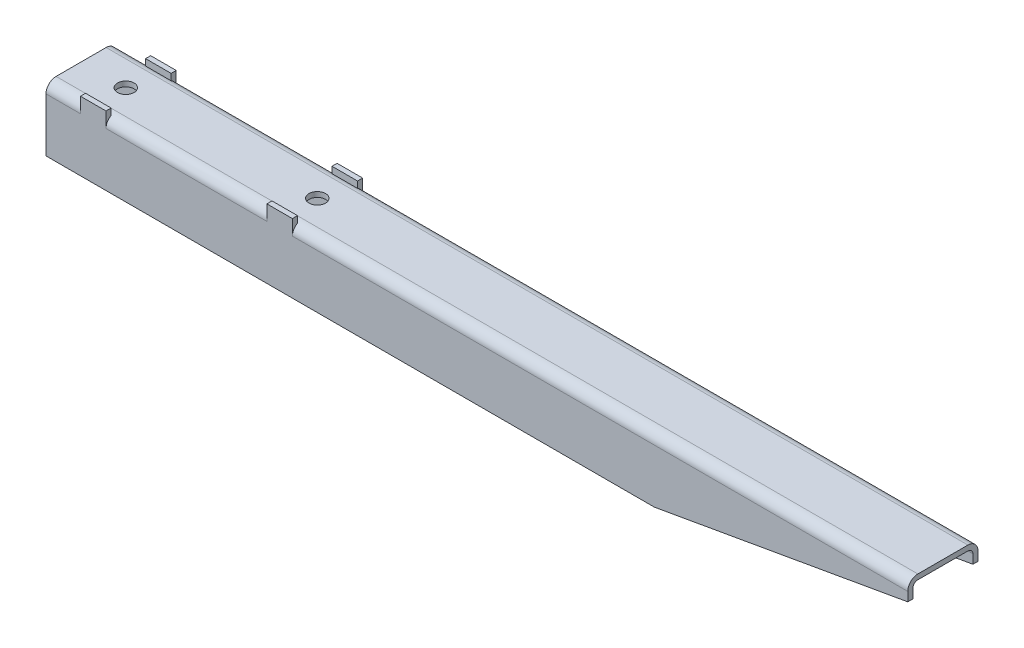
ISO-10303-21;
HEADER;
FILE_DESCRIPTION(('STEP AP214'),'2;1');
FILE_NAME('part.step','',(''),(''),'','','');
FILE_SCHEMA(('AUTOMOTIVE_DESIGN { 1 0 10303 214 1 1 1 1 }'));
ENDSEC;
DATA;
#1=APPLICATION_CONTEXT('core data for automotive mechanical design processes');
#2=APPLICATION_PROTOCOL_DEFINITION('international standard','automotive_design',2000,#1);
#3=PRODUCT_CONTEXT('',#1,'mechanical');
#4=PRODUCT('Part','Part','',(#3));
#5=PRODUCT_RELATED_PRODUCT_CATEGORY('part','',(#4));
#6=PRODUCT_DEFINITION_FORMATION('','',#4);
#7=PRODUCT_DEFINITION_CONTEXT('part definition',#1,'design');
#8=PRODUCT_DEFINITION('design','',#6,#7);
#9=PRODUCT_DEFINITION_SHAPE('','',#8);
#10=(LENGTH_UNIT() NAMED_UNIT(*) SI_UNIT(.MILLI.,.METRE.));
#11=(NAMED_UNIT(*) PLANE_ANGLE_UNIT() SI_UNIT($,.RADIAN.));
#12=(NAMED_UNIT(*) SI_UNIT($,.STERADIAN.) SOLID_ANGLE_UNIT());
#13=UNCERTAINTY_MEASURE_WITH_UNIT(LENGTH_MEASURE(1.E-05),#10,'distance_accuracy_value','');
#14=(GEOMETRIC_REPRESENTATION_CONTEXT(3) GLOBAL_UNCERTAINTY_ASSIGNED_CONTEXT((#13)) GLOBAL_UNIT_ASSIGNED_CONTEXT((#10,
#11,#12)) REPRESENTATION_CONTEXT('',''));
#15=CARTESIAN_POINT('',(0.,0.,0.));
#16=DIRECTION('',(0.,0.,1.));
#17=DIRECTION('',(1.,0.,0.));
#18=AXIS2_PLACEMENT_3D('',#15,#16,#17);
#19=CARTESIAN_POINT('',(675.,50.,27.5));
#20=DIRECTION('',(0.,-1.,0.));
#21=DIRECTION('',(0.,0.,-1.));
#22=AXIS2_PLACEMENT_3D('',#19,#20,#21);
#23=PLANE('',#22);
#24=CARTESIAN_POINT('',(185.,50.,0.));
#25=DIRECTION('',(0.,1.,0.));
#26=DIRECTION('',(0.,0.,1.));
#27=AXIS2_PLACEMENT_3D('',#24,#25,#26);
#28=CIRCLE('',#27,6.50000000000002);
#29=CARTESIAN_POINT('',(185.,50.,6.50000000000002));
#30=VERTEX_POINT('',#29);
#31=EDGE_CURVE('E406',#30,#30,#28,.T.);
#32=ORIENTED_EDGE('',*,*,#31,.F.);
#33=EDGE_LOOP('',(#32));
#34=FACE_BOUND('',#33,.T.);
#35=CARTESIAN_POINT('',(35.,50.,0.));
#36=DIRECTION('',(0.,1.,0.));
#37=DIRECTION('',(0.,0.,1.));
#38=AXIS2_PLACEMENT_3D('',#35,#36,#37);
#39=CIRCLE('',#38,6.5);
#40=CARTESIAN_POINT('',(35.,50.,6.5));
#41=VERTEX_POINT('',#40);
#42=EDGE_CURVE('E414',#41,#41,#39,.T.);
#43=ORIENTED_EDGE('',*,*,#42,.F.);
#44=EDGE_LOOP('',(#43));
#45=FACE_BOUND('',#44,.T.);
#46=DIRECTION('',(0.,0.,1.));
#47=VECTOR('',#46,1.);
#48=CARTESIAN_POINT('',(675.,50.,27.5));
#49=LINE('',#48,#47);
#50=CARTESIAN_POINT('',(675.,50.,-19.6));
#51=VERTEX_POINT('',#50);
#52=CARTESIAN_POINT('',(675.,50.,19.6));
#53=VERTEX_POINT('',#52);
#54=EDGE_CURVE('E459',#51,#53,#49,.T.);
#55=ORIENTED_EDGE('',*,*,#54,.F.);
#56=DIRECTION('',(-1.,0.,0.));
#57=VECTOR('',#56,1.);
#58=CARTESIAN_POINT('',(675.,50.,-19.6));
#59=LINE('',#58,#57);
#60=CARTESIAN_POINT('',(0.,50.,-19.6));
#61=VERTEX_POINT('',#60);
#62=EDGE_CURVE('E550',#51,#61,#59,.T.);
#63=ORIENTED_EDGE('',*,*,#62,.T.);
#64=DIRECTION('',(0.,0.,1.));
#65=VECTOR('',#64,1.);
#66=CARTESIAN_POINT('',(0.,50.,27.5));
#67=LINE('',#66,#65);
#68=CARTESIAN_POINT('',(0.,50.,19.6));
#69=VERTEX_POINT('',#68);
#70=EDGE_CURVE('E489',#61,#69,#67,.T.);
#71=ORIENTED_EDGE('',*,*,#70,.T.);
#72=DIRECTION('',(-1.,0.,0.));
#73=VECTOR('',#72,1.);
#74=CARTESIAN_POINT('',(675.,50.,19.6));
#75=LINE('',#74,#73);
#76=EDGE_CURVE('E547',#69,#53,#75,.F.);
#77=ORIENTED_EDGE('',*,*,#76,.T.);
#78=EDGE_LOOP('',(#55,#63,#71,#77));
#79=FACE_BOUND('',#78,.T.);
#80=ADVANCED_FACE('F42',(#34,#45,#79),#23,.F.);
#81=CARTESIAN_POINT('',(675.,0.,23.5));
#82=DIRECTION('',(0.,1.,0.));
#83=DIRECTION('',(0.,0.,1.));
#84=AXIS2_PLACEMENT_3D('',#81,#82,#83);
#85=PLANE('',#84);
#86=DIRECTION('',(-1.,0.,0.));
#87=VECTOR('',#86,1.);
#88=CARTESIAN_POINT('',(675.,0.,23.5));
#89=LINE('',#88,#87);
#90=CARTESIAN_POINT('',(476.505136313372,0.,23.5));
#91=VERTEX_POINT('',#90);
#92=CARTESIAN_POINT('',(0.,0.,23.5));
#93=VERTEX_POINT('',#92);
#94=EDGE_CURVE('E505',#91,#93,#89,.T.);
#95=ORIENTED_EDGE('',*,*,#94,.F.);
#96=DIRECTION('',(0.,0.,1.));
#97=VECTOR('',#96,1.);
#98=CARTESIAN_POINT('',(476.505136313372,0.,-752.5));
#99=LINE('',#98,#97);
#100=CARTESIAN_POINT('',(476.505136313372,0.,27.5));
#101=VERTEX_POINT('',#100);
#102=EDGE_CURVE('E425',#91,#101,#99,.T.);
#103=ORIENTED_EDGE('',*,*,#102,.T.);
#104=DIRECTION('',(-1.,0.,0.));
#105=VECTOR('',#104,1.);
#106=CARTESIAN_POINT('',(675.,0.,27.5));
#107=LINE('',#106,#105);
#108=CARTESIAN_POINT('',(0.,0.,27.5));
#109=VERTEX_POINT('',#108);
#110=EDGE_CURVE('E466',#101,#109,#107,.T.);
#111=ORIENTED_EDGE('',*,*,#110,.T.);
#112=DIRECTION('',(0.,0.,-1.));
#113=VECTOR('',#112,1.);
#114=CARTESIAN_POINT('',(0.,0.,23.5));
#115=LINE('',#114,#113);
#116=EDGE_CURVE('E442',#109,#93,#115,.T.);
#117=ORIENTED_EDGE('',*,*,#116,.T.);
#118=EDGE_LOOP('',(#95,#103,#111,#117));
#119=FACE_BOUND('',#118,.T.);
#120=ADVANCED_FACE('F716',(#119),#85,.F.);
#121=CARTESIAN_POINT('',(675.,46.,23.5));
#122=DIRECTION('',(0.,0.,1.));
#123=DIRECTION('',(0.,-1.,0.));
#124=AXIS2_PLACEMENT_3D('',#121,#122,#123);
#125=PLANE('',#124);
#126=DIRECTION('',(0.,1.,0.));
#127=VECTOR('',#126,1.);
#128=CARTESIAN_POINT('',(0.,46.,23.5));
#129=LINE('',#128,#127);
#130=CARTESIAN_POINT('',(0.,42.1,23.5));
#131=VERTEX_POINT('',#130);
#132=EDGE_CURVE('E470',#93,#131,#129,.T.);
#133=ORIENTED_EDGE('',*,*,#132,.T.);
#134=DIRECTION('',(-1.,0.,0.));
#135=VECTOR('',#134,1.);
#136=CARTESIAN_POINT('',(675.,42.1,23.5));
#137=LINE('',#136,#135);
#138=CARTESIAN_POINT('',(675.,42.1,23.5));
#139=VERTEX_POINT('',#138);
#140=EDGE_CURVE('E532',#131,#139,#137,.F.);
#141=ORIENTED_EDGE('',*,*,#140,.T.);
#142=DIRECTION('',(0.,1.,0.));
#143=VECTOR('',#142,1.);
#144=CARTESIAN_POINT('',(675.,46.,23.5));
#145=LINE('',#144,#143);
#146=CARTESIAN_POINT('',(675.,35.,23.5));
#147=VERTEX_POINT('',#146);
#148=EDGE_CURVE('E443',#147,#139,#145,.T.);
#149=ORIENTED_EDGE('',*,*,#148,.F.);
#150=DIRECTION('',(-0.984807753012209,-0.173648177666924,0.));
#151=VECTOR('',#150,1.);
#152=CARTESIAN_POINT('',(676.881110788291,35.3316905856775,23.5));
#153=LINE('',#152,#151);
#154=EDGE_CURVE('E438',#147,#91,#153,.T.);
#155=ORIENTED_EDGE('',*,*,#154,.T.);
#156=ORIENTED_EDGE('',*,*,#94,.T.);
#157=EDGE_LOOP('',(#133,#141,#149,#155,#156));
#158=FACE_BOUND('',#157,.T.);
#159=ADVANCED_FACE('F667',(#158),#125,.F.);
#160=CARTESIAN_POINT('',(675.,46.,-23.5));
#161=DIRECTION('',(0.,1.,0.));
#162=DIRECTION('',(0.,0.,1.));
#163=AXIS2_PLACEMENT_3D('',#160,#161,#162);
#164=PLANE('',#163);
#165=CARTESIAN_POINT('',(185.,46.,0.));
#166=DIRECTION('',(0.,1.,0.));
#167=DIRECTION('',(0.,0.,1.));
#168=AXIS2_PLACEMENT_3D('',#165,#166,#167);
#169=CIRCLE('',#168,6.50000000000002);
#170=CARTESIAN_POINT('',(185.,46.,6.50000000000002));
#171=VERTEX_POINT('',#170);
#172=EDGE_CURVE('E410',#171,#171,#169,.T.);
#173=ORIENTED_EDGE('',*,*,#172,.T.);
#174=EDGE_LOOP('',(#173));
#175=FACE_BOUND('',#174,.T.);
#176=CARTESIAN_POINT('',(35.,46.,0.));
#177=DIRECTION('',(0.,1.,0.));
#178=DIRECTION('',(0.,0.,1.));
#179=AXIS2_PLACEMENT_3D('',#176,#177,#178);
#180=CIRCLE('',#179,6.5);
#181=CARTESIAN_POINT('',(35.,46.,6.5));
#182=VERTEX_POINT('',#181);
#183=EDGE_CURVE('E418',#182,#182,#180,.T.);
#184=ORIENTED_EDGE('',*,*,#183,.T.);
#185=EDGE_LOOP('',(#184));
#186=FACE_BOUND('',#185,.T.);
#187=DIRECTION('',(0.,0.,-1.));
#188=VECTOR('',#187,1.);
#189=CARTESIAN_POINT('',(0.,46.,-23.5));
#190=LINE('',#189,#188);
#191=CARTESIAN_POINT('',(0.,46.,19.6));
#192=VERTEX_POINT('',#191);
#193=CARTESIAN_POINT('',(0.,46.,-19.6));
#194=VERTEX_POINT('',#193);
#195=EDGE_CURVE('E474',#192,#194,#190,.T.);
#196=ORIENTED_EDGE('',*,*,#195,.T.);
#197=DIRECTION('',(-1.,0.,0.));
#198=VECTOR('',#197,1.);
#199=CARTESIAN_POINT('',(675.,46.,-19.6));
#200=LINE('',#199,#198);
#201=CARTESIAN_POINT('',(675.,46.,-19.6));
#202=VERTEX_POINT('',#201);
#203=EDGE_CURVE('E529',#194,#202,#200,.F.);
#204=ORIENTED_EDGE('',*,*,#203,.T.);
#205=DIRECTION('',(0.,0.,-1.));
#206=VECTOR('',#205,1.);
#207=CARTESIAN_POINT('',(675.,46.,-23.5));
#208=LINE('',#207,#206);
#209=CARTESIAN_POINT('',(675.,46.,19.6));
#210=VERTEX_POINT('',#209);
#211=EDGE_CURVE('E447',#210,#202,#208,.T.);
#212=ORIENTED_EDGE('',*,*,#211,.F.);
#213=DIRECTION('',(-1.,0.,0.));
#214=VECTOR('',#213,1.);
#215=CARTESIAN_POINT('',(0.,46.,19.6));
#216=LINE('',#215,#214);
#217=EDGE_CURVE('E525',#210,#192,#216,.T.);
#218=ORIENTED_EDGE('',*,*,#217,.T.);
#219=EDGE_LOOP('',(#196,#204,#212,#218));
#220=FACE_BOUND('',#219,.T.);
#221=ADVANCED_FACE('F677',(#175,#186,#220),#164,.F.);
#222=CARTESIAN_POINT('',(675.,0.,-23.5));
#223=DIRECTION('',(0.,0.,-1.));
#224=DIRECTION('',(0.,1.,0.));
#225=AXIS2_PLACEMENT_3D('',#222,#223,#224);
#226=PLANE('',#225);
#227=DIRECTION('',(0.,-1.,0.));
#228=VECTOR('',#227,1.);
#229=CARTESIAN_POINT('',(675.,0.,-23.5));
#230=LINE('',#229,#228);
#231=CARTESIAN_POINT('',(675.,42.1,-23.5));
#232=VERTEX_POINT('',#231);
#233=CARTESIAN_POINT('',(675.,35.,-23.5));
#234=VERTEX_POINT('',#233);
#235=EDGE_CURVE('E452',#232,#234,#230,.T.);
#236=ORIENTED_EDGE('',*,*,#235,.F.);
#237=DIRECTION('',(-1.,0.,0.));
#238=VECTOR('',#237,1.);
#239=CARTESIAN_POINT('',(0.,42.1,-23.5));
#240=LINE('',#239,#238);
#241=CARTESIAN_POINT('',(0.,42.1,-23.5));
#242=VERTEX_POINT('',#241);
#243=EDGE_CURVE('E521',#232,#242,#240,.T.);
#244=ORIENTED_EDGE('',*,*,#243,.T.);
#245=DIRECTION('',(0.,-1.,0.));
#246=VECTOR('',#245,1.);
#247=CARTESIAN_POINT('',(0.,0.,-23.5));
#248=LINE('',#247,#246);
#249=CARTESIAN_POINT('',(0.,0.,-23.5));
#250=VERTEX_POINT('',#249);
#251=EDGE_CURVE('E478',#242,#250,#248,.T.);
#252=ORIENTED_EDGE('',*,*,#251,.T.);
#253=DIRECTION('',(-1.,0.,0.));
#254=VECTOR('',#253,1.);
#255=CARTESIAN_POINT('',(675.,0.,-23.5));
#256=LINE('',#255,#254);
#257=CARTESIAN_POINT('',(476.505136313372,0.,-23.5));
#258=VERTEX_POINT('',#257);
#259=EDGE_CURVE('E501',#258,#250,#256,.T.);
#260=ORIENTED_EDGE('',*,*,#259,.F.);
#261=DIRECTION('',(0.984807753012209,0.173648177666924,0.));
#262=VECTOR('',#261,1.);
#263=CARTESIAN_POINT('',(669.014647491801,33.9446208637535,-23.5));
#264=LINE('',#263,#262);
#265=EDGE_CURVE('E434',#258,#234,#264,.T.);
#266=ORIENTED_EDGE('',*,*,#265,.T.);
#267=EDGE_LOOP('',(#236,#244,#252,#260,#266));
#268=FACE_BOUND('',#267,.T.);
#269=ADVANCED_FACE('F686',(#268),#226,.F.);
#270=CARTESIAN_POINT('',(675.,0.,-27.5));
#271=DIRECTION('',(0.,1.,0.));
#272=DIRECTION('',(0.,0.,1.));
#273=AXIS2_PLACEMENT_3D('',#270,#271,#272);
#274=PLANE('',#273);
#275=DIRECTION('',(-1.,0.,0.));
#276=VECTOR('',#275,1.);
#277=CARTESIAN_POINT('',(675.,0.,-27.5));
#278=LINE('',#277,#276);
#279=CARTESIAN_POINT('',(476.505136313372,0.,-27.5));
#280=VERTEX_POINT('',#279);
#281=CARTESIAN_POINT('',(0.,0.,-27.5));
#282=VERTEX_POINT('',#281);
#283=EDGE_CURVE('E498',#280,#282,#278,.T.);
#284=ORIENTED_EDGE('',*,*,#283,.F.);
#285=EDGE_CURVE('E429',#280,#258,#99,.T.);
#286=ORIENTED_EDGE('',*,*,#285,.T.);
#287=ORIENTED_EDGE('',*,*,#259,.T.);
#288=DIRECTION('',(0.,0.,-1.));
#289=VECTOR('',#288,1.);
#290=CARTESIAN_POINT('',(0.,0.,-27.5));
#291=LINE('',#290,#289);
#292=EDGE_CURVE('E481',#250,#282,#291,.T.);
#293=ORIENTED_EDGE('',*,*,#292,.T.);
#294=EDGE_LOOP('',(#284,#286,#287,#293));
#295=FACE_BOUND('',#294,.T.);
#296=ADVANCED_FACE('F693',(#295),#274,.F.);
#297=CARTESIAN_POINT('',(675.,50.,-27.5));
#298=DIRECTION('',(0.,0.,1.));
#299=DIRECTION('',(0.,-1.,0.));
#300=AXIS2_PLACEMENT_3D('',#297,#298,#299);
#301=PLANE('',#300);
#302=DIRECTION('',(-1.,0.,0.));
#303=VECTOR('',#302,1.);
#304=CARTESIAN_POINT('',(13.5000000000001,42.1,-27.5));
#305=LINE('',#304,#303);
#306=CARTESIAN_POINT('',(0.,42.1,-27.5));
#307=VERTEX_POINT('',#306);
#308=CARTESIAN_POINT('',(27.0000000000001,42.1,-27.5));
#309=VERTEX_POINT('',#308);
#310=EDGE_CURVE('E561',#307,#309,#305,.F.);
#311=ORIENTED_EDGE('',*,*,#310,.T.);
#312=DIRECTION('',(0.,-1.,0.));
#313=VECTOR('',#312,1.);
#314=CARTESIAN_POINT('',(27.,54.,-27.5));
#315=LINE('',#314,#313);
#316=CARTESIAN_POINT('',(27.,54.,-27.5));
#317=VERTEX_POINT('',#316);
#318=EDGE_CURVE('E398',#317,#309,#315,.T.);
#319=ORIENTED_EDGE('',*,*,#318,.F.);
#320=DIRECTION('',(-1.,0.,0.));
#321=VECTOR('',#320,1.);
#322=CARTESIAN_POINT('',(27.,54.,-27.5));
#323=LINE('',#322,#321);
#324=CARTESIAN_POINT('',(47.,54.,-27.5));
#325=VERTEX_POINT('',#324);
#326=EDGE_CURVE('E395',#325,#317,#323,.T.);
#327=ORIENTED_EDGE('',*,*,#326,.F.);
#328=DIRECTION('',(0.,-1.,0.));
#329=VECTOR('',#328,1.);
#330=CARTESIAN_POINT('',(47.,54.,-27.5));
#331=LINE('',#330,#329);
#332=CARTESIAN_POINT('',(47.,42.1,-27.5));
#333=VERTEX_POINT('',#332);
#334=EDGE_CURVE('E403',#325,#333,#331,.T.);
#335=ORIENTED_EDGE('',*,*,#334,.T.);
#336=DIRECTION('',(-1.,0.,0.));
#337=VECTOR('',#336,1.);
#338=CARTESIAN_POINT('',(110.,42.1,-27.5));
#339=LINE('',#338,#337);
#340=CARTESIAN_POINT('',(173.,42.1,-27.5));
#341=VERTEX_POINT('',#340);
#342=EDGE_CURVE('E557',#333,#341,#339,.F.);
#343=ORIENTED_EDGE('',*,*,#342,.T.);
#344=DIRECTION('',(0.,-1.,0.));
#345=VECTOR('',#344,1.);
#346=CARTESIAN_POINT('',(173.,54.,-27.5));
#347=LINE('',#346,#345);
#348=CARTESIAN_POINT('',(173.,54.,-27.5));
#349=VERTEX_POINT('',#348);
#350=EDGE_CURVE('E350',#349,#341,#347,.T.);
#351=ORIENTED_EDGE('',*,*,#350,.F.);
#352=DIRECTION('',(-1.,0.,0.));
#353=VECTOR('',#352,1.);
#354=CARTESIAN_POINT('',(173.,54.,-27.5));
#355=LINE('',#354,#353);
#356=CARTESIAN_POINT('',(193.,54.,-27.5));
#357=VERTEX_POINT('',#356);
#358=EDGE_CURVE('E347',#357,#349,#355,.T.);
#359=ORIENTED_EDGE('',*,*,#358,.F.);
#360=DIRECTION('',(0.,-1.,0.));
#361=VECTOR('',#360,1.);
#362=CARTESIAN_POINT('',(193.,54.,-27.5));
#363=LINE('',#362,#361);
#364=CARTESIAN_POINT('',(193.,42.1,-27.5));
#365=VERTEX_POINT('',#364);
#366=EDGE_CURVE('E353',#357,#365,#363,.T.);
#367=ORIENTED_EDGE('',*,*,#366,.T.);
#368=DIRECTION('',(-1.,0.,0.));
#369=VECTOR('',#368,1.);
#370=CARTESIAN_POINT('',(675.,42.1,-27.5));
#371=LINE('',#370,#369);
#372=CARTESIAN_POINT('',(675.,42.1,-27.5));
#373=VERTEX_POINT('',#372);
#374=EDGE_CURVE('E554',#365,#373,#371,.F.);
#375=ORIENTED_EDGE('',*,*,#374,.T.);
#376=DIRECTION('',(0.,1.,0.));
#377=VECTOR('',#376,1.);
#378=CARTESIAN_POINT('',(675.,50.,-27.5));
#379=LINE('',#378,#377);
#380=CARTESIAN_POINT('',(675.,35.,-27.5));
#381=VERTEX_POINT('',#380);
#382=EDGE_CURVE('E455',#381,#373,#379,.T.);
#383=ORIENTED_EDGE('',*,*,#382,.F.);
#384=DIRECTION('',(-0.984807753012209,-0.173648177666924,0.));
#385=VECTOR('',#384,1.);
#386=CARTESIAN_POINT('',(677.565151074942,35.4523053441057,-27.5));
#387=LINE('',#386,#385);
#388=EDGE_CURVE('E430',#381,#280,#387,.T.);
#389=ORIENTED_EDGE('',*,*,#388,.T.);
#390=ORIENTED_EDGE('',*,*,#283,.T.);
#391=DIRECTION('',(0.,1.,0.));
#392=VECTOR('',#391,1.);
#393=CARTESIAN_POINT('',(0.,50.,-27.5));
#394=LINE('',#393,#392);
#395=EDGE_CURVE('E485',#282,#307,#394,.T.);
#396=ORIENTED_EDGE('',*,*,#395,.T.);
#397=EDGE_LOOP('',(#311,#319,#327,#335,#343,#351,#359,#367,#375,#383,#389,#390,#396));
#398=FACE_BOUND('',#397,.T.);
#399=ADVANCED_FACE('F697',(#398),#301,.F.);
#400=CARTESIAN_POINT('',(675.,0.,27.5));
#401=DIRECTION('',(0.,0.,-1.));
#402=DIRECTION('',(-1.,0.,0.));
#403=AXIS2_PLACEMENT_3D('',#400,#401,#402);
#404=PLANE('',#403);
#405=DIRECTION('',(0.,-1.,0.));
#406=VECTOR('',#405,1.);
#407=CARTESIAN_POINT('',(675.,0.,27.5));
#408=LINE('',#407,#406);
#409=CARTESIAN_POINT('',(675.,42.1,27.5));
#410=VERTEX_POINT('',#409);
#411=CARTESIAN_POINT('',(675.,35.,27.5));
#412=VERTEX_POINT('',#411);
#413=EDGE_CURVE('E463',#410,#412,#408,.T.);
#414=ORIENTED_EDGE('',*,*,#413,.F.);
#415=DIRECTION('',(-1.,0.,0.));
#416=VECTOR('',#415,1.);
#417=CARTESIAN_POINT('',(675.,42.1,27.5));
#418=LINE('',#417,#416);
#419=CARTESIAN_POINT('',(193.,42.1,27.5));
#420=VERTEX_POINT('',#419);
#421=EDGE_CURVE('E583',#410,#420,#418,.T.);
#422=ORIENTED_EDGE('',*,*,#421,.T.);
#423=DIRECTION('',(0.,-1.,0.));
#424=VECTOR('',#423,1.);
#425=CARTESIAN_POINT('',(193.,54.,27.5));
#426=LINE('',#425,#424);
#427=CARTESIAN_POINT('',(193.,54.,27.5));
#428=VERTEX_POINT('',#427);
#429=EDGE_CURVE('E310',#428,#420,#426,.T.);
#430=ORIENTED_EDGE('',*,*,#429,.F.);
#431=DIRECTION('',(1.,0.,0.));
#432=VECTOR('',#431,1.);
#433=CARTESIAN_POINT('',(173.,54.,27.5));
#434=LINE('',#433,#432);
#435=CARTESIAN_POINT('',(173.,54.,27.5));
#436=VERTEX_POINT('',#435);
#437=EDGE_CURVE('E301',#436,#428,#434,.T.);
#438=ORIENTED_EDGE('',*,*,#437,.F.);
#439=DIRECTION('',(0.,-1.,0.));
#440=VECTOR('',#439,1.);
#441=CARTESIAN_POINT('',(173.,54.,27.5));
#442=LINE('',#441,#440);
#443=CARTESIAN_POINT('',(173.,42.1,27.5));
#444=VERTEX_POINT('',#443);
#445=EDGE_CURVE('E307',#436,#444,#442,.T.);
#446=ORIENTED_EDGE('',*,*,#445,.T.);
#447=DIRECTION('',(-1.,0.,0.));
#448=VECTOR('',#447,1.);
#449=CARTESIAN_POINT('',(110.,42.1,27.5));
#450=LINE('',#449,#448);
#451=CARTESIAN_POINT('',(47.,42.1,27.5));
#452=VERTEX_POINT('',#451);
#453=EDGE_CURVE('E580',#444,#452,#450,.T.);
#454=ORIENTED_EDGE('',*,*,#453,.T.);
#455=DIRECTION('',(0.,-1.,0.));
#456=VECTOR('',#455,1.);
#457=CARTESIAN_POINT('',(47.,54.,27.5));
#458=LINE('',#457,#456);
#459=CARTESIAN_POINT('',(47.,54.,27.5));
#460=VERTEX_POINT('',#459);
#461=EDGE_CURVE('E379',#460,#452,#458,.T.);
#462=ORIENTED_EDGE('',*,*,#461,.F.);
#463=DIRECTION('',(1.,0.,0.));
#464=VECTOR('',#463,1.);
#465=CARTESIAN_POINT('',(27.,54.,27.5));
#466=LINE('',#465,#464);
#467=CARTESIAN_POINT('',(27.,54.,27.5));
#468=VERTEX_POINT('',#467);
#469=EDGE_CURVE('E366',#468,#460,#466,.T.);
#470=ORIENTED_EDGE('',*,*,#469,.F.);
#471=DIRECTION('',(0.,-1.,0.));
#472=VECTOR('',#471,1.);
#473=CARTESIAN_POINT('',(27.,54.,27.5));
#474=LINE('',#473,#472);
#475=CARTESIAN_POINT('',(27.0000000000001,42.1,27.5));
#476=VERTEX_POINT('',#475);
#477=EDGE_CURVE('E382',#468,#476,#474,.T.);
#478=ORIENTED_EDGE('',*,*,#477,.T.);
#479=DIRECTION('',(-1.,0.,0.));
#480=VECTOR('',#479,1.);
#481=CARTESIAN_POINT('',(13.5000000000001,42.1,27.5));
#482=LINE('',#481,#480);
#483=CARTESIAN_POINT('',(0.,42.1,27.5));
#484=VERTEX_POINT('',#483);
#485=EDGE_CURVE('E577',#476,#484,#482,.T.);
#486=ORIENTED_EDGE('',*,*,#485,.T.);
#487=DIRECTION('',(0.,-1.,0.));
#488=VECTOR('',#487,1.);
#489=CARTESIAN_POINT('',(0.,0.,27.5));
#490=LINE('',#489,#488);
#491=EDGE_CURVE('E448',#484,#109,#490,.T.);
#492=ORIENTED_EDGE('',*,*,#491,.T.);
#493=ORIENTED_EDGE('',*,*,#110,.F.);
#494=DIRECTION('',(-0.984807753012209,-0.173648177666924,0.));
#495=VECTOR('',#494,1.);
#496=CARTESIAN_POINT('',(675.,35.,27.5));
#497=LINE('',#496,#495);
#498=EDGE_CURVE('E422',#412,#101,#497,.T.);
#499=ORIENTED_EDGE('',*,*,#498,.F.);
#500=EDGE_LOOP('',(#414,#422,#430,#438,#446,#454,#462,#470,#478,#486,#492,#493,#499));
#501=FACE_BOUND('',#500,.T.);
#502=ADVANCED_FACE('F304',(#501),#404,.F.);
#503=CARTESIAN_POINT('',(675.,0.,27.5));
#504=DIRECTION('',(-1.,0.,0.));
#505=DIRECTION('',(0.,0.,1.));
#506=AXIS2_PLACEMENT_3D('',#503,#504,#505);
#507=PLANE('',#506);
#508=ORIENTED_EDGE('',*,*,#382,.T.);
#509=CARTESIAN_POINT('',(675.,42.1,-19.6));
#510=DIRECTION('',(-1.,0.,0.));
#511=DIRECTION('',(0.,0.,1.));
#512=AXIS2_PLACEMENT_3D('',#509,#510,#511);
#513=CIRCLE('',#512,7.9);
#514=EDGE_CURVE('E574',#373,#51,#513,.F.);
#515=ORIENTED_EDGE('',*,*,#514,.T.);
#516=ORIENTED_EDGE('',*,*,#54,.T.);
#517=CARTESIAN_POINT('',(675.,42.1,19.6));
#518=DIRECTION('',(-1.,0.,0.));
#519=DIRECTION('',(0.,0.,1.));
#520=AXIS2_PLACEMENT_3D('',#517,#518,#519);
#521=CIRCLE('',#520,7.9);
#522=EDGE_CURVE('E571',#53,#410,#521,.F.);
#523=ORIENTED_EDGE('',*,*,#522,.T.);
#524=ORIENTED_EDGE('',*,*,#413,.T.);
#525=DIRECTION('',(0.,0.,-1.));
#526=VECTOR('',#525,1.);
#527=CARTESIAN_POINT('',(675.,35.,27.5));
#528=LINE('',#527,#526);
#529=EDGE_CURVE('E512',#412,#147,#528,.T.);
#530=ORIENTED_EDGE('',*,*,#529,.T.);
#531=ORIENTED_EDGE('',*,*,#148,.T.);
#532=CARTESIAN_POINT('',(675.,42.1,19.6));
#533=DIRECTION('',(-1.,0.,0.));
#534=DIRECTION('',(0.,0.,1.));
#535=AXIS2_PLACEMENT_3D('',#532,#533,#534);
#536=CIRCLE('',#535,3.9);
#537=EDGE_CURVE('E544',#139,#210,#536,.T.);
#538=ORIENTED_EDGE('',*,*,#537,.T.);
#539=ORIENTED_EDGE('',*,*,#211,.T.);
#540=CARTESIAN_POINT('',(675.,42.1,-19.6));
#541=DIRECTION('',(-1.,0.,0.));
#542=DIRECTION('',(0.,0.,1.));
#543=AXIS2_PLACEMENT_3D('',#540,#541,#542);
#544=CIRCLE('',#543,3.9);
#545=EDGE_CURVE('E538',#202,#232,#544,.T.);
#546=ORIENTED_EDGE('',*,*,#545,.T.);
#547=ORIENTED_EDGE('',*,*,#235,.T.);
#548=EDGE_CURVE('E508',#234,#381,#528,.T.);
#549=ORIENTED_EDGE('',*,*,#548,.T.);
#550=EDGE_LOOP('',(#508,#515,#516,#523,#524,#530,#531,#538,#539,#546,#547,#549));
#551=FACE_BOUND('',#550,.T.);
#552=ADVANCED_FACE('F662',(#551),#507,.F.);
#553=CARTESIAN_POINT('',(0.,0.,27.5));
#554=DIRECTION('',(-1.,0.,0.));
#555=DIRECTION('',(0.,0.,1.));
#556=AXIS2_PLACEMENT_3D('',#553,#554,#555);
#557=PLANE('',#556);
#558=ORIENTED_EDGE('',*,*,#70,.F.);
#559=CARTESIAN_POINT('',(0.,42.1,-19.6));
#560=DIRECTION('',(-1.,0.,0.));
#561=DIRECTION('',(0.,0.,1.));
#562=AXIS2_PLACEMENT_3D('',#559,#560,#561);
#563=CIRCLE('',#562,7.9);
#564=EDGE_CURVE('E568',#61,#307,#563,.T.);
#565=ORIENTED_EDGE('',*,*,#564,.T.);
#566=ORIENTED_EDGE('',*,*,#395,.F.);
#567=ORIENTED_EDGE('',*,*,#292,.F.);
#568=ORIENTED_EDGE('',*,*,#251,.F.);
#569=CARTESIAN_POINT('',(0.,42.1,-19.6));
#570=DIRECTION('',(-1.,0.,0.));
#571=DIRECTION('',(0.,0.,1.));
#572=AXIS2_PLACEMENT_3D('',#569,#570,#571);
#573=CIRCLE('',#572,3.9);
#574=EDGE_CURVE('E535',#242,#194,#573,.F.);
#575=ORIENTED_EDGE('',*,*,#574,.T.);
#576=ORIENTED_EDGE('',*,*,#195,.F.);
#577=CARTESIAN_POINT('',(0.,42.1,19.6));
#578=DIRECTION('',(-1.,0.,0.));
#579=DIRECTION('',(0.,0.,1.));
#580=AXIS2_PLACEMENT_3D('',#577,#578,#579);
#581=CIRCLE('',#580,3.9);
#582=EDGE_CURVE('E541',#192,#131,#581,.F.);
#583=ORIENTED_EDGE('',*,*,#582,.T.);
#584=ORIENTED_EDGE('',*,*,#132,.F.);
#585=ORIENTED_EDGE('',*,*,#116,.F.);
#586=ORIENTED_EDGE('',*,*,#491,.F.);
#587=CARTESIAN_POINT('',(0.,42.1,19.6));
#588=DIRECTION('',(-1.,0.,0.));
#589=DIRECTION('',(0.,0.,1.));
#590=AXIS2_PLACEMENT_3D('',#587,#588,#589);
#591=CIRCLE('',#590,7.9);
#592=EDGE_CURVE('E565',#484,#69,#591,.T.);
#593=ORIENTED_EDGE('',*,*,#592,.T.);
#594=EDGE_LOOP('',(#558,#565,#566,#567,#568,#575,#576,#583,#584,#585,#586,#593));
#595=FACE_BOUND('',#594,.T.);
#596=ADVANCED_FACE('F711',(#595),#557,.T.);
#597=CARTESIAN_POINT('',(675.,35.,-752.5));
#598=DIRECTION('',(-0.173648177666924,0.984807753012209,0.));
#599=DIRECTION('',(-0.984807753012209,-0.173648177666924,0.));
#600=AXIS2_PLACEMENT_3D('',#597,#598,#599);
#601=PLANE('',#600);
#602=ORIENTED_EDGE('',*,*,#285,.F.);
#603=ORIENTED_EDGE('',*,*,#388,.F.);
#604=ORIENTED_EDGE('',*,*,#548,.F.);
#605=ORIENTED_EDGE('',*,*,#265,.F.);
#606=EDGE_LOOP('',(#602,#603,#604,#605));
#607=FACE_BOUND('',#606,.T.);
#608=ADVANCED_FACE('F690',(#607),#601,.F.);
#609=ORIENTED_EDGE('',*,*,#529,.F.);
#610=ORIENTED_EDGE('',*,*,#498,.T.);
#611=ORIENTED_EDGE('',*,*,#102,.F.);
#612=ORIENTED_EDGE('',*,*,#154,.F.);
#613=EDGE_LOOP('',(#609,#610,#611,#612));
#614=FACE_BOUND('',#613,.T.);
#615=ADVANCED_FACE('F714',(#614),#601,.F.);
#616=CARTESIAN_POINT('',(35.,-730.,0.));
#617=DIRECTION('',(0.,1.,0.));
#618=DIRECTION('',(0.,0.,1.));
#619=AXIS2_PLACEMENT_3D('',#616,#617,#618);
#620=CYLINDRICAL_SURFACE('',#619,6.5);
#621=ORIENTED_EDGE('',*,*,#42,.T.);
#622=EDGE_LOOP('',(#621));
#623=FACE_BOUND('',#622,.T.);
#624=ORIENTED_EDGE('',*,*,#183,.F.);
#625=EDGE_LOOP('',(#624));
#626=FACE_BOUND('',#625,.T.);
#627=ADVANCED_FACE('F975',(#623,#626),#620,.F.);
#628=CARTESIAN_POINT('',(185.,-730.,0.));
#629=DIRECTION('',(0.,1.,0.));
#630=DIRECTION('',(0.,0.,1.));
#631=AXIS2_PLACEMENT_3D('',#628,#629,#630);
#632=CYLINDRICAL_SURFACE('',#631,6.50000000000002);
#633=ORIENTED_EDGE('',*,*,#31,.T.);
#634=EDGE_LOOP('',(#633));
#635=FACE_BOUND('',#634,.T.);
#636=ORIENTED_EDGE('',*,*,#172,.F.);
#637=EDGE_LOOP('',(#636));
#638=FACE_BOUND('',#637,.T.);
#639=ADVANCED_FACE('F860',(#635,#638),#632,.F.);
#640=CARTESIAN_POINT('',(27.,54.,-27.5));
#641=DIRECTION('',(1.,0.,0.));
#642=DIRECTION('',(0.,0.,-1.));
#643=AXIS2_PLACEMENT_3D('',#640,#641,#642);
#644=PLANE('',#643);
#645=ORIENTED_EDGE('',*,*,#318,.T.);
#646=CARTESIAN_POINT('',(27.,42.1,-19.6));
#647=DIRECTION('',(1.,0.,0.));
#648=DIRECTION('',(0.,0.,-1.));
#649=AXIS2_PLACEMENT_3D('',#646,#647,#648);
#650=CIRCLE('',#649,7.9);
#651=CARTESIAN_POINT('',(27.,48.9702256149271,-23.5));
#652=VERTEX_POINT('',#651);
#653=EDGE_CURVE('E586',#309,#652,#650,.T.);
#654=ORIENTED_EDGE('',*,*,#653,.T.);
#655=DIRECTION('',(0.,-1.,0.));
#656=VECTOR('',#655,1.);
#657=CARTESIAN_POINT('',(27.,54.,-23.5));
#658=LINE('',#657,#656);
#659=CARTESIAN_POINT('',(27.,54.,-23.5));
#660=VERTEX_POINT('',#659);
#661=EDGE_CURVE('E402',#660,#652,#658,.T.);
#662=ORIENTED_EDGE('',*,*,#661,.F.);
#663=DIRECTION('',(0.,0.,1.));
#664=VECTOR('',#663,1.);
#665=CARTESIAN_POINT('',(27.,54.,-27.5));
#666=LINE('',#665,#664);
#667=EDGE_CURVE('E385',#317,#660,#666,.T.);
#668=ORIENTED_EDGE('',*,*,#667,.F.);
#669=EDGE_LOOP('',(#645,#654,#662,#668));
#670=FACE_BOUND('',#669,.T.);
#671=ADVANCED_FACE('F850',(#670),#644,.F.);
#672=CARTESIAN_POINT('',(27.,54.,-23.5));
#673=DIRECTION('',(0.,0.,-1.));
#674=DIRECTION('',(-1.,0.,0.));
#675=AXIS2_PLACEMENT_3D('',#672,#673,#674);
#676=PLANE('',#675);
#677=ORIENTED_EDGE('',*,*,#661,.T.);
#678=DIRECTION('',(-1.,0.,0.));
#679=VECTOR('',#678,1.);
#680=CARTESIAN_POINT('',(27.,48.9702256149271,-23.5));
#681=LINE('',#680,#679);
#682=CARTESIAN_POINT('',(47.,48.9702256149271,-23.5));
#683=VERTEX_POINT('',#682);
#684=EDGE_CURVE('E590',#652,#683,#681,.F.);
#685=ORIENTED_EDGE('',*,*,#684,.T.);
#686=DIRECTION('',(0.,-1.,0.));
#687=VECTOR('',#686,1.);
#688=CARTESIAN_POINT('',(47.,54.,-23.5));
#689=LINE('',#688,#687);
#690=CARTESIAN_POINT('',(47.,54.,-23.5));
#691=VERTEX_POINT('',#690);
#692=EDGE_CURVE('E399',#691,#683,#689,.T.);
#693=ORIENTED_EDGE('',*,*,#692,.F.);
#694=DIRECTION('',(1.,0.,0.));
#695=VECTOR('',#694,1.);
#696=CARTESIAN_POINT('',(27.,54.,-23.5));
#697=LINE('',#696,#695);
#698=EDGE_CURVE('E389',#660,#691,#697,.T.);
#699=ORIENTED_EDGE('',*,*,#698,.F.);
#700=EDGE_LOOP('',(#677,#685,#693,#699));
#701=FACE_BOUND('',#700,.T.);
#702=ADVANCED_FACE('F840',(#701),#676,.F.);
#703=CARTESIAN_POINT('',(47.,54.,-27.5));
#704=DIRECTION('',(-1.,0.,0.));
#705=DIRECTION('',(0.,0.,1.));
#706=AXIS2_PLACEMENT_3D('',#703,#704,#705);
#707=PLANE('',#706);
#708=ORIENTED_EDGE('',*,*,#692,.T.);
#709=CARTESIAN_POINT('',(47.,42.1,-19.6));
#710=DIRECTION('',(-1.,0.,0.));
#711=DIRECTION('',(0.,0.,1.));
#712=AXIS2_PLACEMENT_3D('',#709,#710,#711);
#713=CIRCLE('',#712,7.9);
#714=EDGE_CURVE('E594',#683,#333,#713,.T.);
#715=ORIENTED_EDGE('',*,*,#714,.T.);
#716=ORIENTED_EDGE('',*,*,#334,.F.);
#717=DIRECTION('',(0.,0.,-1.));
#718=VECTOR('',#717,1.);
#719=CARTESIAN_POINT('',(47.,54.,-27.5));
#720=LINE('',#719,#718);
#721=EDGE_CURVE('E392',#691,#325,#720,.T.);
#722=ORIENTED_EDGE('',*,*,#721,.F.);
#723=EDGE_LOOP('',(#708,#715,#716,#722));
#724=FACE_BOUND('',#723,.T.);
#725=ADVANCED_FACE('F835',(#724),#707,.F.);
#726=CARTESIAN_POINT('',(27.,54.,-23.5));
#727=DIRECTION('',(0.,1.,0.));
#728=DIRECTION('',(0.,0.,1.));
#729=AXIS2_PLACEMENT_3D('',#726,#727,#728);
#730=PLANE('',#729);
#731=ORIENTED_EDGE('',*,*,#667,.T.);
#732=ORIENTED_EDGE('',*,*,#698,.T.);
#733=ORIENTED_EDGE('',*,*,#721,.T.);
#734=ORIENTED_EDGE('',*,*,#326,.T.);
#735=EDGE_LOOP('',(#731,#732,#733,#734));
#736=FACE_BOUND('',#735,.T.);
#737=ADVANCED_FACE('F828',(#736),#730,.T.);
#738=CARTESIAN_POINT('',(27.,54.,27.5));
#739=DIRECTION('',(1.,0.,0.));
#740=DIRECTION('',(0.,0.,-1.));
#741=AXIS2_PLACEMENT_3D('',#738,#739,#740);
#742=PLANE('',#741);
#743=DIRECTION('',(0.,-1.,0.));
#744=VECTOR('',#743,1.);
#745=CARTESIAN_POINT('',(27.,54.,23.5));
#746=LINE('',#745,#744);
#747=CARTESIAN_POINT('',(27.,54.,23.5));
#748=VERTEX_POINT('',#747);
#749=CARTESIAN_POINT('',(27.,48.9702256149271,23.5));
#750=VERTEX_POINT('',#749);
#751=EDGE_CURVE('E60',#748,#750,#746,.T.);
#752=ORIENTED_EDGE('',*,*,#751,.T.);
#753=CARTESIAN_POINT('',(27.,42.1,19.6));
#754=DIRECTION('',(1.,0.,0.));
#755=DIRECTION('',(0.,0.,-1.));
#756=AXIS2_PLACEMENT_3D('',#753,#754,#755);
#757=CIRCLE('',#756,7.9);
#758=EDGE_CURVE('E11',#750,#476,#757,.T.);
#759=ORIENTED_EDGE('',*,*,#758,.T.);
#760=ORIENTED_EDGE('',*,*,#477,.F.);
#761=DIRECTION('',(0.,0.,1.));
#762=VECTOR('',#761,1.);
#763=CARTESIAN_POINT('',(27.,54.,27.5));
#764=LINE('',#763,#762);
#765=EDGE_CURVE('E362',#748,#468,#764,.T.);
#766=ORIENTED_EDGE('',*,*,#765,.F.);
#767=EDGE_LOOP('',(#752,#759,#760,#766));
#768=FACE_BOUND('',#767,.T.);
#769=ADVANCED_FACE('F632',(#768),#742,.F.);
#770=CARTESIAN_POINT('',(47.,54.,27.5));
#771=DIRECTION('',(-1.,0.,0.));
#772=DIRECTION('',(0.,0.,1.));
#773=AXIS2_PLACEMENT_3D('',#770,#771,#772);
#774=PLANE('',#773);
#775=ORIENTED_EDGE('',*,*,#461,.T.);
#776=CARTESIAN_POINT('',(47.,42.1,19.6));
#777=DIRECTION('',(-1.,0.,0.));
#778=DIRECTION('',(0.,0.,1.));
#779=AXIS2_PLACEMENT_3D('',#776,#777,#778);
#780=CIRCLE('',#779,7.9);
#781=CARTESIAN_POINT('',(47.,48.9702256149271,23.5));
#782=VERTEX_POINT('',#781);
#783=EDGE_CURVE('E620',#452,#782,#780,.T.);
#784=ORIENTED_EDGE('',*,*,#783,.T.);
#785=DIRECTION('',(0.,-1.,0.));
#786=VECTOR('',#785,1.);
#787=CARTESIAN_POINT('',(47.,54.,23.5));
#788=LINE('',#787,#786);
#789=CARTESIAN_POINT('',(47.,54.,23.5));
#790=VERTEX_POINT('',#789);
#791=EDGE_CURVE('E70',#790,#782,#788,.T.);
#792=ORIENTED_EDGE('',*,*,#791,.F.);
#793=DIRECTION('',(0.,0.,-1.));
#794=VECTOR('',#793,1.);
#795=CARTESIAN_POINT('',(47.,54.,27.5));
#796=LINE('',#795,#794);
#797=EDGE_CURVE('E369',#460,#790,#796,.T.);
#798=ORIENTED_EDGE('',*,*,#797,.F.);
#799=EDGE_LOOP('',(#775,#784,#792,#798));
#800=FACE_BOUND('',#799,.T.);
#801=ADVANCED_FACE('F639',(#800),#774,.F.);
#802=CARTESIAN_POINT('',(27.,54.,23.5));
#803=DIRECTION('',(0.,0.,1.));
#804=DIRECTION('',(1.,0.,0.));
#805=AXIS2_PLACEMENT_3D('',#802,#803,#804);
#806=PLANE('',#805);
#807=ORIENTED_EDGE('',*,*,#791,.T.);
#808=DIRECTION('',(-1.,0.,0.));
#809=VECTOR('',#808,1.);
#810=CARTESIAN_POINT('',(47.,48.9702256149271,23.5));
#811=LINE('',#810,#809);
#812=EDGE_CURVE('E51',#782,#750,#811,.T.);
#813=ORIENTED_EDGE('',*,*,#812,.T.);
#814=ORIENTED_EDGE('',*,*,#751,.F.);
#815=DIRECTION('',(-1.,0.,0.));
#816=VECTOR('',#815,1.);
#817=CARTESIAN_POINT('',(27.,54.,23.5));
#818=LINE('',#817,#816);
#819=EDGE_CURVE('E372',#790,#748,#818,.T.);
#820=ORIENTED_EDGE('',*,*,#819,.F.);
#821=EDGE_LOOP('',(#807,#813,#814,#820));
#822=FACE_BOUND('',#821,.T.);
#823=ADVANCED_FACE('F625',(#822),#806,.F.);
#824=CARTESIAN_POINT('',(27.,54.,23.5));
#825=DIRECTION('',(0.,-1.,0.));
#826=DIRECTION('',(0.,0.,-1.));
#827=AXIS2_PLACEMENT_3D('',#824,#825,#826);
#828=PLANE('',#827);
#829=ORIENTED_EDGE('',*,*,#765,.T.);
#830=ORIENTED_EDGE('',*,*,#469,.T.);
#831=ORIENTED_EDGE('',*,*,#797,.T.);
#832=ORIENTED_EDGE('',*,*,#819,.T.);
#833=EDGE_LOOP('',(#829,#830,#831,#832));
#834=FACE_BOUND('',#833,.T.);
#835=ADVANCED_FACE('F637',(#834),#828,.F.);
#836=CARTESIAN_POINT('',(173.,54.,-27.5));
#837=DIRECTION('',(1.,0.,0.));
#838=DIRECTION('',(0.,0.,-1.));
#839=AXIS2_PLACEMENT_3D('',#836,#837,#838);
#840=PLANE('',#839);
#841=ORIENTED_EDGE('',*,*,#350,.T.);
#842=CARTESIAN_POINT('',(173.,42.1,-19.6));
#843=DIRECTION('',(1.,0.,0.));
#844=DIRECTION('',(0.,0.,-1.));
#845=AXIS2_PLACEMENT_3D('',#842,#843,#844);
#846=CIRCLE('',#845,7.9);
#847=CARTESIAN_POINT('',(173.,48.9702256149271,-23.5));
#848=VERTEX_POINT('',#847);
#849=EDGE_CURVE('E598',#341,#848,#846,.T.);
#850=ORIENTED_EDGE('',*,*,#849,.T.);
#851=DIRECTION('',(0.,-1.,0.));
#852=VECTOR('',#851,1.);
#853=CARTESIAN_POINT('',(173.,54.,-23.5));
#854=LINE('',#853,#852);
#855=CARTESIAN_POINT('',(173.,54.,-23.5));
#856=VERTEX_POINT('',#855);
#857=EDGE_CURVE('E359',#856,#848,#854,.T.);
#858=ORIENTED_EDGE('',*,*,#857,.F.);
#859=DIRECTION('',(0.,0.,1.));
#860=VECTOR('',#859,1.);
#861=CARTESIAN_POINT('',(173.,54.,-27.5));
#862=LINE('',#861,#860);
#863=EDGE_CURVE('E330',#349,#856,#862,.T.);
#864=ORIENTED_EDGE('',*,*,#863,.F.);
#865=EDGE_LOOP('',(#841,#850,#858,#864));
#866=FACE_BOUND('',#865,.T.);
#867=ADVANCED_FACE('F791',(#866),#840,.F.);
#868=CARTESIAN_POINT('',(173.,54.,-23.5));
#869=DIRECTION('',(0.,0.,-1.));
#870=DIRECTION('',(-1.,0.,0.));
#871=AXIS2_PLACEMENT_3D('',#868,#869,#870);
#872=PLANE('',#871);
#873=ORIENTED_EDGE('',*,*,#857,.T.);
#874=DIRECTION('',(-1.,0.,0.));
#875=VECTOR('',#874,1.);
#876=CARTESIAN_POINT('',(173.,48.9702256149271,-23.5));
#877=LINE('',#876,#875);
#878=CARTESIAN_POINT('',(193.,48.9702256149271,-23.5));
#879=VERTEX_POINT('',#878);
#880=EDGE_CURVE('E602',#848,#879,#877,.F.);
#881=ORIENTED_EDGE('',*,*,#880,.T.);
#882=DIRECTION('',(0.,-1.,0.));
#883=VECTOR('',#882,1.);
#884=CARTESIAN_POINT('',(193.,54.,-23.5));
#885=LINE('',#884,#883);
#886=CARTESIAN_POINT('',(193.,54.,-23.5));
#887=VERTEX_POINT('',#886);
#888=EDGE_CURVE('E356',#887,#879,#885,.T.);
#889=ORIENTED_EDGE('',*,*,#888,.F.);
#890=DIRECTION('',(1.,0.,0.));
#891=VECTOR('',#890,1.);
#892=CARTESIAN_POINT('',(173.,54.,-23.5));
#893=LINE('',#892,#891);
#894=EDGE_CURVE('E335',#856,#887,#893,.T.);
#895=ORIENTED_EDGE('',*,*,#894,.F.);
#896=EDGE_LOOP('',(#873,#881,#889,#895));
#897=FACE_BOUND('',#896,.T.);
#898=ADVANCED_FACE('F781',(#897),#872,.F.);
#899=CARTESIAN_POINT('',(193.,54.,-27.5));
#900=DIRECTION('',(-1.,0.,0.));
#901=DIRECTION('',(0.,0.,1.));
#902=AXIS2_PLACEMENT_3D('',#899,#900,#901);
#903=PLANE('',#902);
#904=ORIENTED_EDGE('',*,*,#888,.T.);
#905=CARTESIAN_POINT('',(193.,42.1,-19.6));
#906=DIRECTION('',(-1.,0.,0.));
#907=DIRECTION('',(0.,0.,1.));
#908=AXIS2_PLACEMENT_3D('',#905,#906,#907);
#909=CIRCLE('',#908,7.9);
#910=EDGE_CURVE('E606',#879,#365,#909,.T.);
#911=ORIENTED_EDGE('',*,*,#910,.T.);
#912=ORIENTED_EDGE('',*,*,#366,.F.);
#913=DIRECTION('',(0.,0.,-1.));
#914=VECTOR('',#913,1.);
#915=CARTESIAN_POINT('',(193.,54.,-27.5));
#916=LINE('',#915,#914);
#917=EDGE_CURVE('E344',#887,#357,#916,.T.);
#918=ORIENTED_EDGE('',*,*,#917,.F.);
#919=EDGE_LOOP('',(#904,#911,#912,#918));
#920=FACE_BOUND('',#919,.T.);
#921=ADVANCED_FACE('F776',(#920),#903,.F.);
#922=CARTESIAN_POINT('',(173.,54.,-23.5));
#923=DIRECTION('',(0.,1.,0.));
#924=DIRECTION('',(0.,0.,1.));
#925=AXIS2_PLACEMENT_3D('',#922,#923,#924);
#926=PLANE('',#925);
#927=ORIENTED_EDGE('',*,*,#863,.T.);
#928=ORIENTED_EDGE('',*,*,#894,.T.);
#929=ORIENTED_EDGE('',*,*,#917,.T.);
#930=ORIENTED_EDGE('',*,*,#358,.T.);
#931=EDGE_LOOP('',(#927,#928,#929,#930));
#932=FACE_BOUND('',#931,.T.);
#933=ADVANCED_FACE('F769',(#932),#926,.T.);
#934=CARTESIAN_POINT('',(173.,54.,23.5));
#935=DIRECTION('',(1.,0.,0.));
#936=DIRECTION('',(0.,0.,-1.));
#937=AXIS2_PLACEMENT_3D('',#934,#935,#936);
#938=PLANE('',#937);
#939=DIRECTION('',(0.,-1.,0.));
#940=VECTOR('',#939,1.);
#941=CARTESIAN_POINT('',(173.,54.,23.5));
#942=LINE('',#941,#940);
#943=CARTESIAN_POINT('',(173.,54.,23.5));
#944=VERTEX_POINT('',#943);
#945=CARTESIAN_POINT('',(173.,48.9702256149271,23.5));
#946=VERTEX_POINT('',#945);
#947=EDGE_CURVE('E645',#944,#946,#942,.T.);
#948=ORIENTED_EDGE('',*,*,#947,.T.);
#949=CARTESIAN_POINT('',(173.,42.1,19.6));
#950=DIRECTION('',(1.,0.,0.));
#951=DIRECTION('',(0.,0.,-1.));
#952=AXIS2_PLACEMENT_3D('',#949,#950,#951);
#953=CIRCLE('',#952,7.9);
#954=EDGE_CURVE('E327',#946,#444,#953,.T.);
#955=ORIENTED_EDGE('',*,*,#954,.T.);
#956=ORIENTED_EDGE('',*,*,#445,.F.);
#957=DIRECTION('',(0.,0.,1.));
#958=VECTOR('',#957,1.);
#959=CARTESIAN_POINT('',(173.,54.,23.5));
#960=LINE('',#959,#958);
#961=EDGE_CURVE('E315',#944,#436,#960,.T.);
#962=ORIENTED_EDGE('',*,*,#961,.F.);
#963=EDGE_LOOP('',(#948,#955,#956,#962));
#964=FACE_BOUND('',#963,.T.);
#965=ADVANCED_FACE('F325',(#964),#938,.F.);
#966=CARTESIAN_POINT('',(193.,54.,23.5));
#967=DIRECTION('',(-1.,0.,0.));
#968=DIRECTION('',(0.,0.,1.));
#969=AXIS2_PLACEMENT_3D('',#966,#967,#968);
#970=PLANE('',#969);
#971=ORIENTED_EDGE('',*,*,#429,.T.);
#972=CARTESIAN_POINT('',(193.,42.1,19.6));
#973=DIRECTION('',(-1.,0.,0.));
#974=DIRECTION('',(0.,0.,1.));
#975=AXIS2_PLACEMENT_3D('',#972,#973,#974);
#976=CIRCLE('',#975,7.9);
#977=CARTESIAN_POINT('',(193.,48.9702256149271,23.5));
#978=VERTEX_POINT('',#977);
#979=EDGE_CURVE('E610',#420,#978,#976,.T.);
#980=ORIENTED_EDGE('',*,*,#979,.T.);
#981=DIRECTION('',(0.,-1.,0.));
#982=VECTOR('',#981,1.);
#983=CARTESIAN_POINT('',(193.,54.,23.5));
#984=LINE('',#983,#982);
#985=CARTESIAN_POINT('',(193.,54.,23.5));
#986=VERTEX_POINT('',#985);
#987=EDGE_CURVE('E338',#986,#978,#984,.T.);
#988=ORIENTED_EDGE('',*,*,#987,.F.);
#989=DIRECTION('',(0.,0.,-1.));
#990=VECTOR('',#989,1.);
#991=CARTESIAN_POINT('',(193.,54.,23.5));
#992=LINE('',#991,#990);
#993=EDGE_CURVE('E314',#428,#986,#992,.T.);
#994=ORIENTED_EDGE('',*,*,#993,.F.);
#995=EDGE_LOOP('',(#971,#980,#988,#994));
#996=FACE_BOUND('',#995,.T.);
#997=ADVANCED_FACE('F649',(#996),#970,.F.);
#998=CARTESIAN_POINT('',(173.,54.,23.5));
#999=DIRECTION('',(0.,0.,1.));
#1000=DIRECTION('',(1.,0.,0.));
#1001=AXIS2_PLACEMENT_3D('',#998,#999,#1000);
#1002=PLANE('',#1001);
#1003=ORIENTED_EDGE('',*,*,#987,.T.);
#1004=DIRECTION('',(-1.,0.,0.));
#1005=VECTOR('',#1004,1.);
#1006=CARTESIAN_POINT('',(193.,48.9702256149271,23.5));
#1007=LINE('',#1006,#1005);
#1008=EDGE_CURVE('E614',#978,#946,#1007,.T.);
#1009=ORIENTED_EDGE('',*,*,#1008,.T.);
#1010=ORIENTED_EDGE('',*,*,#947,.F.);
#1011=DIRECTION('',(-1.,0.,0.));
#1012=VECTOR('',#1011,1.);
#1013=CARTESIAN_POINT('',(173.,54.,23.5));
#1014=LINE('',#1013,#1012);
#1015=EDGE_CURVE('E320',#986,#944,#1014,.T.);
#1016=ORIENTED_EDGE('',*,*,#1015,.F.);
#1017=EDGE_LOOP('',(#1003,#1009,#1010,#1016));
#1018=FACE_BOUND('',#1017,.T.);
#1019=ADVANCED_FACE('F644',(#1018),#1002,.F.);
#1020=CARTESIAN_POINT('',(173.,54.,27.5));
#1021=DIRECTION('',(0.,1.,0.));
#1022=DIRECTION('',(0.,0.,1.));
#1023=AXIS2_PLACEMENT_3D('',#1020,#1021,#1022);
#1024=PLANE('',#1023);
#1025=ORIENTED_EDGE('',*,*,#961,.T.);
#1026=ORIENTED_EDGE('',*,*,#437,.T.);
#1027=ORIENTED_EDGE('',*,*,#993,.T.);
#1028=ORIENTED_EDGE('',*,*,#1015,.T.);
#1029=EDGE_LOOP('',(#1025,#1026,#1027,#1028));
#1030=FACE_BOUND('',#1029,.T.);
#1031=ADVANCED_FACE('F318',(#1030),#1024,.T.);
#1032=CARTESIAN_POINT('',(675.,42.1,-19.6));
#1033=DIRECTION('',(1.,0.,0.));
#1034=DIRECTION('',(0.,0.,-1.));
#1035=AXIS2_PLACEMENT_3D('',#1032,#1033,#1034);
#1036=CYLINDRICAL_SURFACE('',#1035,3.9);
#1037=ORIENTED_EDGE('',*,*,#545,.F.);
#1038=ORIENTED_EDGE('',*,*,#203,.F.);
#1039=ORIENTED_EDGE('',*,*,#574,.F.);
#1040=ORIENTED_EDGE('',*,*,#243,.F.);
#1041=EDGE_LOOP('',(#1037,#1038,#1039,#1040));
#1042=FACE_BOUND('',#1041,.T.);
#1043=ADVANCED_FACE('F681',(#1042),#1036,.F.);
#1044=CARTESIAN_POINT('',(675.,42.1,19.6));
#1045=DIRECTION('',(1.,0.,0.));
#1046=DIRECTION('',(0.,0.,-1.));
#1047=AXIS2_PLACEMENT_3D('',#1044,#1045,#1046);
#1048=CYLINDRICAL_SURFACE('',#1047,3.9);
#1049=ORIENTED_EDGE('',*,*,#537,.F.);
#1050=ORIENTED_EDGE('',*,*,#140,.F.);
#1051=ORIENTED_EDGE('',*,*,#582,.F.);
#1052=ORIENTED_EDGE('',*,*,#217,.F.);
#1053=EDGE_LOOP('',(#1049,#1050,#1051,#1052));
#1054=FACE_BOUND('',#1053,.T.);
#1055=ADVANCED_FACE('F672',(#1054),#1048,.F.);
#1056=CARTESIAN_POINT('',(675.,42.1,-19.6));
#1057=DIRECTION('',(-1.,0.,0.));
#1058=DIRECTION('',(0.,0.,1.));
#1059=AXIS2_PLACEMENT_3D('',#1056,#1057,#1058);
#1060=CYLINDRICAL_SURFACE('',#1059,7.9);
#1061=ORIENTED_EDGE('',*,*,#514,.F.);
#1062=ORIENTED_EDGE('',*,*,#374,.F.);
#1063=ORIENTED_EDGE('',*,*,#910,.F.);
#1064=ORIENTED_EDGE('',*,*,#880,.F.);
#1065=ORIENTED_EDGE('',*,*,#849,.F.);
#1066=ORIENTED_EDGE('',*,*,#342,.F.);
#1067=ORIENTED_EDGE('',*,*,#714,.F.);
#1068=ORIENTED_EDGE('',*,*,#684,.F.);
#1069=ORIENTED_EDGE('',*,*,#653,.F.);
#1070=ORIENTED_EDGE('',*,*,#310,.F.);
#1071=ORIENTED_EDGE('',*,*,#564,.F.);
#1072=ORIENTED_EDGE('',*,*,#62,.F.);
#1073=EDGE_LOOP('',(#1061,#1062,#1063,#1064,#1065,#1066,#1067,#1068,#1069,#1070,#1071,#1072));
#1074=FACE_BOUND('',#1073,.T.);
#1075=ADVANCED_FACE('F705',(#1074),#1060,.T.);
#1076=CARTESIAN_POINT('',(675.,42.1,19.6));
#1077=DIRECTION('',(-1.,0.,0.));
#1078=DIRECTION('',(0.,0.,1.));
#1079=AXIS2_PLACEMENT_3D('',#1076,#1077,#1078);
#1080=CYLINDRICAL_SURFACE('',#1079,7.9);
#1081=ORIENTED_EDGE('',*,*,#522,.F.);
#1082=ORIENTED_EDGE('',*,*,#76,.F.);
#1083=ORIENTED_EDGE('',*,*,#592,.F.);
#1084=ORIENTED_EDGE('',*,*,#485,.F.);
#1085=ORIENTED_EDGE('',*,*,#758,.F.);
#1086=ORIENTED_EDGE('',*,*,#812,.F.);
#1087=ORIENTED_EDGE('',*,*,#783,.F.);
#1088=ORIENTED_EDGE('',*,*,#453,.F.);
#1089=ORIENTED_EDGE('',*,*,#954,.F.);
#1090=ORIENTED_EDGE('',*,*,#1008,.F.);
#1091=ORIENTED_EDGE('',*,*,#979,.F.);
#1092=ORIENTED_EDGE('',*,*,#421,.F.);
#1093=EDGE_LOOP('',(#1081,#1082,#1083,#1084,#1085,#1086,#1087,#1088,#1089,#1090,#1091,#1092));
#1094=FACE_BOUND('',#1093,.T.);
#1095=ADVANCED_FACE('F44',(#1094),#1080,.T.);
#1096=CLOSED_SHELL('',(#80,#120,#159,#221,#269,#296,#399,#502,#552,#596,#608,#615,#627,#639,
#671,#702,#725,#737,#769,#801,#823,#835,#867,#898,#921,#933,#965,#997,#1019,#1031,#1043,#1055,
#1075,#1095));
#1097=MANIFOLD_SOLID_BREP('B2',#1096);
#1098=ADVANCED_BREP_SHAPE_REPRESENTATION('',(#18,#1097),#14);
#1099=SHAPE_DEFINITION_REPRESENTATION(#9,#1098);
ENDSEC;
END-ISO-10303-21;
